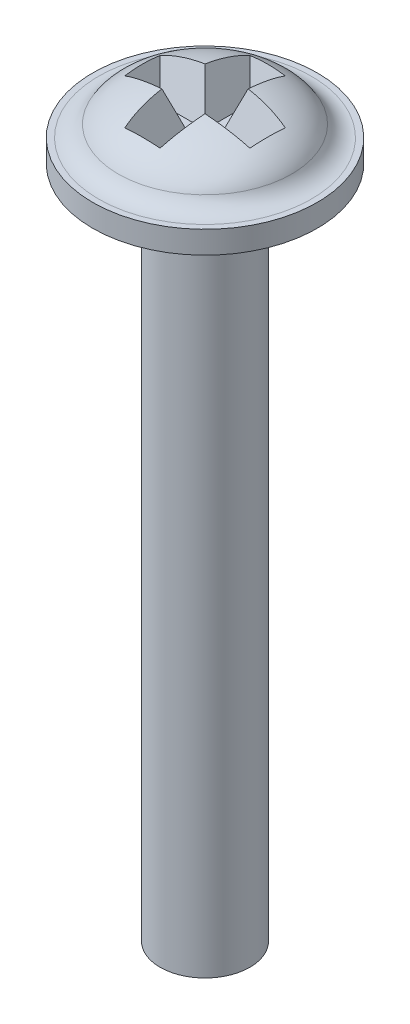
ISO-10303-21;
HEADER;
FILE_DESCRIPTION(('STEP AP214'),'2;1');
FILE_NAME('part.step','',(''),(''),'','','');
FILE_SCHEMA(('AUTOMOTIVE_DESIGN { 1 0 10303 214 1 1 1 1 }'));
ENDSEC;
DATA;
#1=APPLICATION_CONTEXT('core data for automotive mechanical design processes');
#2=APPLICATION_PROTOCOL_DEFINITION('international standard','automotive_design',2000,#1);
#3=PRODUCT_CONTEXT('',#1,'mechanical');
#4=PRODUCT('Part','Part','',(#3));
#5=PRODUCT_RELATED_PRODUCT_CATEGORY('part','',(#4));
#6=PRODUCT_DEFINITION_FORMATION('','',#4);
#7=PRODUCT_DEFINITION_CONTEXT('part definition',#1,'design');
#8=PRODUCT_DEFINITION('design','',#6,#7);
#9=PRODUCT_DEFINITION_SHAPE('','',#8);
#10=(LENGTH_UNIT() NAMED_UNIT(*) SI_UNIT(.MILLI.,.METRE.));
#11=(NAMED_UNIT(*) PLANE_ANGLE_UNIT() SI_UNIT($,.RADIAN.));
#12=(NAMED_UNIT(*) SI_UNIT($,.STERADIAN.) SOLID_ANGLE_UNIT());
#13=UNCERTAINTY_MEASURE_WITH_UNIT(LENGTH_MEASURE(1.E-05),#10,'distance_accuracy_value','');
#14=(GEOMETRIC_REPRESENTATION_CONTEXT(3) GLOBAL_UNCERTAINTY_ASSIGNED_CONTEXT((#13)) GLOBAL_UNIT_ASSIGNED_CONTEXT((#10,
#11,#12)) REPRESENTATION_CONTEXT('',''));
#15=CARTESIAN_POINT('',(0.,0.,0.));
#16=DIRECTION('',(0.,0.,1.));
#17=DIRECTION('',(1.,0.,0.));
#18=AXIS2_PLACEMENT_3D('',#15,#16,#17);
#19=CARTESIAN_POINT('',(0.,0.,0.));
#20=DIRECTION('',(0.,1.,0.));
#21=DIRECTION('',(0.,0.,1.));
#22=AXIS2_PLACEMENT_3D('',#19,#20,#21);
#23=PLANE('',#22);
#24=CARTESIAN_POINT('',(0.,0.,0.));
#25=DIRECTION('',(0.,1.,0.));
#26=DIRECTION('',(0.,0.,1.));
#27=AXIS2_PLACEMENT_3D('',#24,#25,#26);
#28=CIRCLE('',#27,2.5);
#29=CARTESIAN_POINT('',(0.,0.,2.5));
#30=VERTEX_POINT('',#29);
#31=EDGE_CURVE('E147',#30,#30,#28,.T.);
#32=ORIENTED_EDGE('',*,*,#31,.F.);
#33=EDGE_LOOP('',(#32));
#34=FACE_BOUND('',#33,.T.);
#35=CARTESIAN_POINT('',(0.,0.,0.));
#36=DIRECTION('',(0.,1.,0.));
#37=DIRECTION('',(0.,0.,1.));
#38=AXIS2_PLACEMENT_3D('',#35,#36,#37);
#39=CIRCLE('',#38,1.);
#40=CARTESIAN_POINT('',(0.,0.,1.));
#41=VERTEX_POINT('',#40);
#42=EDGE_CURVE('E11',#41,#41,#39,.F.);
#43=ORIENTED_EDGE('',*,*,#42,.F.);
#44=EDGE_LOOP('',(#43));
#45=FACE_BOUND('',#44,.T.);
#46=ADVANCED_FACE('F33',(#34,#45),#23,.F.);
#47=CARTESIAN_POINT('',(0.,0.5,0.));
#48=DIRECTION('',(0.,-1.,0.));
#49=DIRECTION('',(0.,0.,-1.));
#50=AXIS2_PLACEMENT_3D('',#47,#48,#49);
#51=CYLINDRICAL_SURFACE('',#50,2.5);
#52=CARTESIAN_POINT('',(0.,0.5,0.));
#53=DIRECTION('',(0.,1.,0.));
#54=DIRECTION('',(0.,0.,1.));
#55=AXIS2_PLACEMENT_3D('',#52,#53,#54);
#56=CIRCLE('',#55,2.5);
#57=CARTESIAN_POINT('',(0.,0.5,2.5));
#58=VERTEX_POINT('',#57);
#59=EDGE_CURVE('E150',#58,#58,#56,.T.);
#60=ORIENTED_EDGE('',*,*,#59,.F.);
#61=EDGE_LOOP('',(#60));
#62=FACE_BOUND('',#61,.T.);
#63=ORIENTED_EDGE('',*,*,#31,.T.);
#64=EDGE_LOOP('',(#63));
#65=FACE_BOUND('',#64,.T.);
#66=ADVANCED_FACE('F296',(#62,#65),#51,.T.);
#67=CARTESIAN_POINT('',(0.,0.5,0.));
#68=DIRECTION('',(0.,1.,0.));
#69=DIRECTION('',(0.,0.,1.));
#70=AXIS2_PLACEMENT_3D('',#67,#68,#69);
#71=PLANE('',#70);
#72=CARTESIAN_POINT('',(0.,0.5,0.));
#73=DIRECTION('',(0.,1.,0.));
#74=DIRECTION('',(0.,0.,1.));
#75=AXIS2_PLACEMENT_3D('',#72,#73,#74);
#76=CIRCLE('',#75,2.36985867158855);
#77=CARTESIAN_POINT('',(0.,0.5,2.36985867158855));
#78=VERTEX_POINT('',#77);
#79=EDGE_CURVE('E381',#78,#78,#76,.F.);
#80=ORIENTED_EDGE('',*,*,#79,.T.);
#81=EDGE_LOOP('',(#80));
#82=FACE_BOUND('',#81,.T.);
#83=ORIENTED_EDGE('',*,*,#59,.T.);
#84=EDGE_LOOP('',(#83));
#85=FACE_BOUND('',#84,.T.);
#86=ADVANCED_FACE('F166',(#82,#85),#71,.T.);
#87=CARTESIAN_POINT('',(0.,0.5,0.));
#88=DIRECTION('',(1.,0.,0.));
#89=DIRECTION('',(0.,0.,1.));
#90=AXIS2_PLACEMENT_3D('',#87,#88,#89);
#91=ELLIPSE('',#90,2.,1.);
#92=TRIMMED_CURVE('',#91,(PARAMETER_VALUE(4.71238898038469)),
(PARAMETER_VALUE(7.85398163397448)),.T.,.PARAMETER.);
#93=CARTESIAN_POINT('',(0.,1.5,0.));
#94=DIRECTION('',(0.,1.,0.));
#95=AXIS1_PLACEMENT('',#93,#94);
#96=SURFACE_OF_REVOLUTION('',#92,#95);
#97=CARTESIAN_POINT('',(0.488598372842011,1.46688727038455,-0.14760642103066));
#98=CARTESIAN_POINT('',(0.487805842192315,1.46458559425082,-0.210325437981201));
#99=CARTESIAN_POINT('',(0.486513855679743,1.4608333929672,-0.272967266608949));
#100=CARTESIAN_POINT('',(0.482894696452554,1.45032259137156,-0.397985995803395));
#101=CARTESIAN_POINT('',(0.480567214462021,1.44356309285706,-0.460362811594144));
#102=CARTESIAN_POINT('',(0.47206777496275,1.41887892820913,-0.64492896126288));
#103=CARTESIAN_POINT('',(0.464355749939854,1.39648158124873,-0.766524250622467));
#104=CARTESIAN_POINT('',(0.44974084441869,1.35403681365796,-0.940114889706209));
#105=CARTESIAN_POINT('',(0.444720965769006,1.33945802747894,-0.993648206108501));
#106=CARTESIAN_POINT('',(0.433630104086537,1.30724782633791,-1.09965987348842));
#107=CARTESIAN_POINT('',(0.427559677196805,1.28961802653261,-1.15213876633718));
#108=CARTESIAN_POINT('',(0.414162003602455,1.25070835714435,-1.25640518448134));
#109=CARTESIAN_POINT('',(0.406818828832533,1.22938222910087,-1.30817368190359));
#110=CARTESIAN_POINT('',(0.394782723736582,1.19442684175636,-1.38435442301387));
#111=CARTESIAN_POINT('',(0.390596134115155,1.18226810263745,-1.4095251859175));
#112=CARTESIAN_POINT('',(0.381856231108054,1.15688558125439,-1.45927020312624));
#113=CARTESIAN_POINT('',(0.377302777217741,1.14366139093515,-1.48384422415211));
#114=CARTESIAN_POINT('',(0.372553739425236,1.12986918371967,-1.50806596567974));
#115=B_SPLINE_CURVE_WITH_KNOTS('',3,(#97,#98,#99,#100,#101,#102,#103,#104,#105,#106,#107,#108,
#109,#110,#111,#112,#113,#114),.UNSPECIFIED.,.F.,.F.,(4,2,2,2,2,2,2,2,4),(0.,0.188241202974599,
0.376538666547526,0.747243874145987,0.914295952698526,1.08125986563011,1.25048808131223,
1.33525858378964,1.42006170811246),.UNSPECIFIED.);
#116=CARTESIAN_POINT('',(0.479595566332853,1.44074122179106,-0.479595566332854));
#117=VERTEX_POINT('',#116);
#118=CARTESIAN_POINT('',(0.393247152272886,1.18996721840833,-1.39324715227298));
#119=VERTEX_POINT('',#118);
#120=EDGE_CURVE('E41',#117,#119,#115,.T.);
#121=ORIENTED_EDGE('',*,*,#120,.F.);
#122=CARTESIAN_POINT('',(1.50806596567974,1.12986918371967,-0.372553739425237));
#123=CARTESIAN_POINT('',(1.47144651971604,1.15070678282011,-0.379728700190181));
#124=CARTESIAN_POINT('',(1.43403983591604,1.17025925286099,-0.386461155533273));
#125=CARTESIAN_POINT('',(1.35805182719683,1.20697635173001,-0.399103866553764));
#126=CARTESIAN_POINT('',(1.31947368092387,1.22414684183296,-0.405016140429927));
#127=CARTESIAN_POINT('',(1.2413768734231,1.25637591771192,-0.41611350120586));
#128=CARTESIAN_POINT('',(1.20185872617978,1.2714356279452,-0.421298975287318));
#129=CARTESIAN_POINT('',(1.12265193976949,1.29941989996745,-0.430934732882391));
#130=CARTESIAN_POINT('',(1.08297438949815,1.31237264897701,-0.435394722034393));
#131=CARTESIAN_POINT('',(1.00301206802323,1.33655252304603,-0.443720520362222));
#132=CARTESIAN_POINT('',(0.962726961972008,1.34777865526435,-0.447585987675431));
#133=CARTESIAN_POINT('',(0.881689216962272,1.36860601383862,-0.454757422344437));
#134=CARTESIAN_POINT('',(0.840936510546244,1.37820700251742,-0.458063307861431));
#135=CARTESIAN_POINT('',(0.693671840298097,1.40999370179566,-0.469008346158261));
#136=CARTESIAN_POINT('',(0.586062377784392,1.42779526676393,-0.475137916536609));
#137=CARTESIAN_POINT('',(0.423074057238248,1.44761470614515,-0.481962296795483));
#138=CARTESIAN_POINT('',(0.368116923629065,1.45308672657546,-0.483846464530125));
#139=CARTESIAN_POINT('',(0.257994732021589,1.46171082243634,-0.486815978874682));
#140=CARTESIAN_POINT('',(0.202829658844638,1.4648627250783,-0.487901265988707));
#141=CARTESIAN_POINT('',(0.147606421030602,1.46688727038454,-0.488598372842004));
#142=B_SPLINE_CURVE_WITH_KNOTS('',3,(#122,#123,#124,#125,#126,#127,#128,#129,#130,#131,#132,
#133,#134,#135,#136,#137,#138,#139,#140,#141),.UNSPECIFIED.,.F.,.F.,(4,2,2,2,2,2,2,2,2,4),(0.,
0.128151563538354,0.255981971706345,0.383744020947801,0.50962383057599,0.635575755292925,
0.761546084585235,1.08865966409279,1.25440284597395,1.42015837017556),.UNSPECIFIED.);
#143=CARTESIAN_POINT('',(1.39324715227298,1.18996721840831,-0.393247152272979));
#144=VERTEX_POINT('',#143);
#145=EDGE_CURVE('E56',#144,#117,#142,.T.);
#146=ORIENTED_EDGE('',*,*,#145,.F.);
#147=CARTESIAN_POINT('',(1.38780409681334,1.17415943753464,0.506));
#148=CARTESIAN_POINT('',(1.39010870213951,1.18085249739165,0.463981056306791));
#149=CARTESIAN_POINT('',(1.39210765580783,1.18665788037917,0.421807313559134));
#150=CARTESIAN_POINT('',(1.39550419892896,1.19652215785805,0.337450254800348));
#151=CARTESIAN_POINT('',(1.39690480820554,1.20058982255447,0.295268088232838));
#152=CARTESIAN_POINT('',(1.39913404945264,1.20706400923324,0.210903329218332));
#153=CARTESIAN_POINT('',(1.39996456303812,1.20947599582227,0.168721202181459));
#154=CARTESIAN_POINT('',(1.40106927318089,1.21268430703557,0.0843593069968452));
#155=CARTESIAN_POINT('',(1.40134440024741,1.21348333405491,0.042179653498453));
#156=CARTESIAN_POINT('',(1.40134440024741,1.21348333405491,-0.0421796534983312));
#157=CARTESIAN_POINT('',(1.40106927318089,1.21268430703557,-0.0843593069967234));
#158=CARTESIAN_POINT('',(1.39996456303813,1.20947599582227,-0.168721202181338));
#159=CARTESIAN_POINT('',(1.39913404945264,1.20706400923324,-0.210903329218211));
#160=CARTESIAN_POINT('',(1.39690480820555,1.20058982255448,-0.295268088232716));
#161=CARTESIAN_POINT('',(1.39550419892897,1.19652215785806,-0.337450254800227));
#162=CARTESIAN_POINT('',(1.39210765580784,1.18665788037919,-0.421807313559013));
#163=CARTESIAN_POINT('',(1.39010870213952,1.18085249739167,-0.463981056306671));
#164=CARTESIAN_POINT('',(1.38780409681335,1.17415943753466,-0.50599999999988));
#165=B_SPLINE_CURVE_WITH_KNOTS('',3,(#147,#148,#149,#150,#151,#152,#153,#154,#155,#156,#157,
#158,#159,#160,#161,#162,#163,#164),.UNSPECIFIED.,.F.,.F.,(4,2,2,2,2,2,2,2,4),(0.,
0.127817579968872,0.254982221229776,0.381725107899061,0.508255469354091,0.63478583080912,
0.761528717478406,0.888693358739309,1.01651093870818),.UNSPECIFIED.);
#166=CARTESIAN_POINT('',(1.39324715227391,1.18996721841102,0.393247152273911));
#167=VERTEX_POINT('',#166);
#168=EDGE_CURVE('E238',#167,#144,#165,.T.);
#169=ORIENTED_EDGE('',*,*,#168,.F.);
#170=CARTESIAN_POINT('',(0.147606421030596,1.46688727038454,0.488598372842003));
#171=CARTESIAN_POINT('',(0.210325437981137,1.46458559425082,0.487805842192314));
#172=CARTESIAN_POINT('',(0.272967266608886,1.46083339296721,0.486513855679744));
#173=CARTESIAN_POINT('',(0.397985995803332,1.45032259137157,0.482894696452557));
#174=CARTESIAN_POINT('',(0.46036281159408,1.44356309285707,0.480567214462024));
#175=CARTESIAN_POINT('',(0.644928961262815,1.41887892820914,0.472067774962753));
#176=CARTESIAN_POINT('',(0.766524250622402,1.39648158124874,0.464355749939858));
#177=CARTESIAN_POINT('',(0.94011488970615,1.35403681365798,0.449740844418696));
#178=CARTESIAN_POINT('',(0.993648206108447,1.33945802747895,0.444720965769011));
#179=CARTESIAN_POINT('',(1.09965987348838,1.30724782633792,0.433630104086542));
#180=CARTESIAN_POINT('',(1.15213876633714,1.28961802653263,0.427559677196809));
#181=CARTESIAN_POINT('',(1.25640518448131,1.25070835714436,0.414162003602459));
#182=CARTESIAN_POINT('',(1.30817368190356,1.22938222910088,0.406818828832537));
#183=CARTESIAN_POINT('',(1.38435442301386,1.19442684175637,0.394782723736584));
#184=CARTESIAN_POINT('',(1.40952518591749,1.18226810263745,0.390596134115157));
#185=CARTESIAN_POINT('',(1.45927020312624,1.1568855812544,0.381856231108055));
#186=CARTESIAN_POINT('',(1.48384422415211,1.14366139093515,0.377302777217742));
#187=CARTESIAN_POINT('',(1.50806596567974,1.12986918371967,0.372553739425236));
#188=B_SPLINE_CURVE_WITH_KNOTS('',3,(#170,#171,#172,#173,#174,#175,#176,#177,#178,#179,#180,
#181,#182,#183,#184,#185,#186,#187),.UNSPECIFIED.,.F.,.F.,(4,2,2,2,2,2,2,2,4),(0.,
0.188241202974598,0.376538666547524,0.747243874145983,0.914295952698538,1.08125986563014,
1.25048808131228,1.33525858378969,1.42006170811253),.UNSPECIFIED.);
#189=CARTESIAN_POINT('',(0.479595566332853,1.44074122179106,0.479595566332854));
#190=VERTEX_POINT('',#189);
#191=EDGE_CURVE('E232',#190,#167,#188,.T.);
#192=ORIENTED_EDGE('',*,*,#191,.F.);
#193=CARTESIAN_POINT('',(0.372553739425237,1.12986918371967,1.50806596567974));
#194=CARTESIAN_POINT('',(0.37972870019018,1.15070678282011,1.47144651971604));
#195=CARTESIAN_POINT('',(0.386461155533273,1.17025925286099,1.43403983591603));
#196=CARTESIAN_POINT('',(0.399103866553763,1.20697635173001,1.35805182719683));
#197=CARTESIAN_POINT('',(0.405016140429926,1.22414684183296,1.31947368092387));
#198=CARTESIAN_POINT('',(0.41611350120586,1.25637591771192,1.2413768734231));
#199=CARTESIAN_POINT('',(0.421298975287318,1.2714356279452,1.20185872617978));
#200=CARTESIAN_POINT('',(0.430934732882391,1.29941989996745,1.12265193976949));
#201=CARTESIAN_POINT('',(0.435394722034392,1.31237264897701,1.08297438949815));
#202=CARTESIAN_POINT('',(0.443720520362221,1.33655252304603,1.00301206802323));
#203=CARTESIAN_POINT('',(0.447585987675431,1.34777865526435,0.962726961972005));
#204=CARTESIAN_POINT('',(0.454757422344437,1.36860601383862,0.881689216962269));
#205=CARTESIAN_POINT('',(0.458063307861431,1.37820700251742,0.84093651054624));
#206=CARTESIAN_POINT('',(0.469008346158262,1.40999370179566,0.693671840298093));
#207=CARTESIAN_POINT('',(0.475137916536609,1.42779526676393,0.586062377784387));
#208=CARTESIAN_POINT('',(0.481962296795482,1.44761470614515,0.423074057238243));
#209=CARTESIAN_POINT('',(0.483846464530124,1.45308672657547,0.36811692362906));
#210=CARTESIAN_POINT('',(0.486815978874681,1.46171082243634,0.257994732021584));
#211=CARTESIAN_POINT('',(0.487901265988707,1.4648627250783,0.202829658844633));
#212=CARTESIAN_POINT('',(0.488598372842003,1.46688727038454,0.147606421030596));
#213=B_SPLINE_CURVE_WITH_KNOTS('',3,(#193,#194,#195,#196,#197,#198,#199,#200,#201,#202,#203,
#204,#205,#206,#207,#208,#209,#210,#211,#212),.UNSPECIFIED.,.F.,.F.,(4,2,2,2,2,2,2,2,2,4),(0.,
0.128151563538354,0.255981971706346,0.383744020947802,0.509623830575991,0.635575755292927,
0.761546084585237,1.08865966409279,1.25440284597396,1.42015837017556),.UNSPECIFIED.);
#214=CARTESIAN_POINT('',(0.393247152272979,1.18996721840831,1.39324715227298));
#215=VERTEX_POINT('',#214);
#216=EDGE_CURVE('E225',#215,#190,#213,.T.);
#217=ORIENTED_EDGE('',*,*,#216,.F.);
#218=CARTESIAN_POINT('',(-0.506,1.17415943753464,1.38780409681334));
#219=CARTESIAN_POINT('',(-0.463981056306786,1.18085249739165,1.39010870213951));
#220=CARTESIAN_POINT('',(-0.421807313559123,1.18665788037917,1.39210765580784));
#221=CARTESIAN_POINT('',(-0.337450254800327,1.19652215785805,1.39550419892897));
#222=CARTESIAN_POINT('',(-0.295268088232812,1.20058982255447,1.39690480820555));
#223=CARTESIAN_POINT('',(-0.210903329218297,1.20706400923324,1.39913404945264));
#224=CARTESIAN_POINT('',(-0.168721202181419,1.20947599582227,1.39996456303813));
#225=CARTESIAN_POINT('',(-0.0843593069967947,1.21268430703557,1.40106927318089));
#226=CARTESIAN_POINT('',(-0.0421796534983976,1.21348333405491,1.40134440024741));
#227=CARTESIAN_POINT('',(0.0421796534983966,1.21348333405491,1.40134440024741));
#228=CARTESIAN_POINT('',(0.0843593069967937,1.21268430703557,1.40106927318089));
#229=CARTESIAN_POINT('',(0.168721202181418,1.20947599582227,1.39996456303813));
#230=CARTESIAN_POINT('',(0.210903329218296,1.20706400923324,1.39913404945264));
#231=CARTESIAN_POINT('',(0.295268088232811,1.20058982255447,1.39690480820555));
#232=CARTESIAN_POINT('',(0.337450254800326,1.19652215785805,1.39550419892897));
#233=CARTESIAN_POINT('',(0.421807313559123,1.18665788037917,1.39210765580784));
#234=CARTESIAN_POINT('',(0.463981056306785,1.18085249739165,1.39010870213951));
#235=CARTESIAN_POINT('',(0.505999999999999,1.17415943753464,1.38780409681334));
#236=B_SPLINE_CURVE_WITH_KNOTS('',3,(#218,#219,#220,#221,#222,#223,#224,#225,#226,#227,#228,
#229,#230,#231,#232,#233,#234,#235),.UNSPECIFIED.,.F.,.F.,(4,2,2,2,2,2,2,2,4),(0.,
0.127817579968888,0.254982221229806,0.381725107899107,0.508255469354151,0.634785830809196,
0.761528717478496,0.888693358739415,1.0165109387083),.UNSPECIFIED.);
#237=CARTESIAN_POINT('',(-0.393247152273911,1.18996721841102,1.39324715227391));
#238=VERTEX_POINT('',#237);
#239=EDGE_CURVE('E218',#238,#215,#236,.T.);
#240=ORIENTED_EDGE('',*,*,#239,.F.);
#241=CARTESIAN_POINT('',(-0.488598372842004,1.46688727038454,0.147606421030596));
#242=CARTESIAN_POINT('',(-0.487805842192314,1.46458559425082,0.210325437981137));
#243=CARTESIAN_POINT('',(-0.486513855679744,1.46083339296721,0.272967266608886));
#244=CARTESIAN_POINT('',(-0.482894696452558,1.45032259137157,0.397985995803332));
#245=CARTESIAN_POINT('',(-0.480567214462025,1.44356309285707,0.46036281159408));
#246=CARTESIAN_POINT('',(-0.472067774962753,1.41887892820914,0.644928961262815));
#247=CARTESIAN_POINT('',(-0.464355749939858,1.39648158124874,0.766524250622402));
#248=CARTESIAN_POINT('',(-0.449740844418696,1.35403681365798,0.94011488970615));
#249=CARTESIAN_POINT('',(-0.444720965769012,1.33945802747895,0.993648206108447));
#250=CARTESIAN_POINT('',(-0.433630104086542,1.30724782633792,1.09965987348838));
#251=CARTESIAN_POINT('',(-0.42755967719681,1.28961802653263,1.15213876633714));
#252=CARTESIAN_POINT('',(-0.414162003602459,1.25070835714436,1.25640518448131));
#253=CARTESIAN_POINT('',(-0.406818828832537,1.22938222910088,1.30817368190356));
#254=CARTESIAN_POINT('',(-0.394782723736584,1.19442684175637,1.38435442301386));
#255=CARTESIAN_POINT('',(-0.390596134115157,1.18226810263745,1.40952518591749));
#256=CARTESIAN_POINT('',(-0.381856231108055,1.1568855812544,1.45927020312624));
#257=CARTESIAN_POINT('',(-0.377302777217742,1.14366139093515,1.48384422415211));
#258=CARTESIAN_POINT('',(-0.372553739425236,1.12986918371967,1.50806596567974));
#259=B_SPLINE_CURVE_WITH_KNOTS('',3,(#241,#242,#243,#244,#245,#246,#247,#248,#249,#250,#251,
#252,#253,#254,#255,#256,#257,#258),.UNSPECIFIED.,.F.,.F.,(4,2,2,2,2,2,2,2,4),(0.,
0.188241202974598,0.376538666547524,0.747243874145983,0.914295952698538,1.08125986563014,
1.25048808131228,1.33525858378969,1.42006170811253),.UNSPECIFIED.);
#260=CARTESIAN_POINT('',(-0.479595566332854,1.44074122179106,0.479595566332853));
#261=VERTEX_POINT('',#260);
#262=EDGE_CURVE('E211',#261,#238,#259,.T.);
#263=ORIENTED_EDGE('',*,*,#262,.F.);
#264=CARTESIAN_POINT('',(-1.50806596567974,1.12986918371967,0.372553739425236));
#265=CARTESIAN_POINT('',(-1.47144651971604,1.15070678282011,0.37972870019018));
#266=CARTESIAN_POINT('',(-1.43403983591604,1.17025925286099,0.386461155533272));
#267=CARTESIAN_POINT('',(-1.35805182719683,1.20697635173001,0.399103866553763));
#268=CARTESIAN_POINT('',(-1.31947368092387,1.22414684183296,0.405016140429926));
#269=CARTESIAN_POINT('',(-1.2413768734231,1.25637591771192,0.416113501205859));
#270=CARTESIAN_POINT('',(-1.20185872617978,1.27143562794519,0.421298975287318));
#271=CARTESIAN_POINT('',(-1.12265193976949,1.29941989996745,0.43093473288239));
#272=CARTESIAN_POINT('',(-1.08297438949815,1.31237264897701,0.435394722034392));
#273=CARTESIAN_POINT('',(-1.00301206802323,1.33655252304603,0.443720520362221));
#274=CARTESIAN_POINT('',(-0.96272696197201,1.34777865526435,0.447585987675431));
#275=CARTESIAN_POINT('',(-0.881689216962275,1.36860601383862,0.454757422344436));
#276=CARTESIAN_POINT('',(-0.840936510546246,1.37820700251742,0.45806330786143));
#277=CARTESIAN_POINT('',(-0.693671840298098,1.40999370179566,0.46900834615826));
#278=CARTESIAN_POINT('',(-0.586062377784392,1.42779526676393,0.475137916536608));
#279=CARTESIAN_POINT('',(-0.423074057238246,1.44761470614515,0.481962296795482));
#280=CARTESIAN_POINT('',(-0.368116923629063,1.45308672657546,0.483846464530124));
#281=CARTESIAN_POINT('',(-0.257994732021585,1.46171082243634,0.486815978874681));
#282=CARTESIAN_POINT('',(-0.202829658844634,1.4648627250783,0.487901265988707));
#283=CARTESIAN_POINT('',(-0.147606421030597,1.46688727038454,0.488598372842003));
#284=B_SPLINE_CURVE_WITH_KNOTS('',3,(#264,#265,#266,#267,#268,#269,#270,#271,#272,#273,#274,
#275,#276,#277,#278,#279,#280,#281,#282,#283),.UNSPECIFIED.,.F.,.F.,(4,2,2,2,2,2,2,2,2,4),(0.,
0.128151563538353,0.255981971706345,0.3837440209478,0.509623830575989,0.635575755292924,
0.761546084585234,1.08865966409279,1.25440284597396,1.42015837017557),.UNSPECIFIED.);
#285=CARTESIAN_POINT('',(-1.39324715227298,1.18996721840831,0.393247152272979));
#286=VERTEX_POINT('',#285);
#287=EDGE_CURVE('E204',#286,#261,#284,.T.);
#288=ORIENTED_EDGE('',*,*,#287,.F.);
#289=CARTESIAN_POINT('',(-1.38780409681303,1.17415943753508,-0.505999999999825));
#290=CARTESIAN_POINT('',(-1.3901087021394,1.18085249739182,-0.463981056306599));
#291=CARTESIAN_POINT('',(-1.39210765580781,1.18665788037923,-0.42180731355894));
#292=CARTESIAN_POINT('',(-1.395504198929,1.19652215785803,-0.337450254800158));
#293=CARTESIAN_POINT('',(-1.39690480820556,1.20058982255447,-0.295268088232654));
#294=CARTESIAN_POINT('',(-1.39913404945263,1.20706400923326,-0.210903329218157));
#295=CARTESIAN_POINT('',(-1.39996456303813,1.20947599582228,-0.168721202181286));
#296=CARTESIAN_POINT('',(-1.40106927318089,1.21268430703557,-0.084359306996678));
#297=CARTESIAN_POINT('',(-1.40134440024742,1.21348333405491,-0.0421796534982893));
#298=CARTESIAN_POINT('',(-1.40134440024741,1.21348333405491,0.0421796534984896));
#299=CARTESIAN_POINT('',(-1.40106927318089,1.21268430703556,0.0843593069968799));
#300=CARTESIAN_POINT('',(-1.39996456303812,1.20947599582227,0.168721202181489));
#301=CARTESIAN_POINT('',(-1.39913404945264,1.20706400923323,0.210903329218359));
#302=CARTESIAN_POINT('',(-1.39690480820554,1.20058982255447,0.295268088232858));
#303=CARTESIAN_POINT('',(-1.39550419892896,1.19652215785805,0.337450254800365));
#304=CARTESIAN_POINT('',(-1.39210765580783,1.18665788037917,0.421807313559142));
#305=CARTESIAN_POINT('',(-1.39010870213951,1.18085249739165,0.463981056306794));
#306=CARTESIAN_POINT('',(-1.38780409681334,1.17415943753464,0.505999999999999));
#307=B_SPLINE_CURVE_WITH_KNOTS('',3,(#289,#290,#291,#292,#293,#294,#295,#296,#297,#298,#299,
#300,#301,#302,#303,#304,#305,#306),.UNSPECIFIED.,.F.,.F.,(4,2,2,2,2,2,2,2,4),(0.,
0.127817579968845,0.254982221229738,0.381725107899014,0.508255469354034,0.634785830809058,
0.761528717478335,0.888693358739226,1.01651093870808),.UNSPECIFIED.);
#308=CARTESIAN_POINT('',(-1.39324715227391,1.18996721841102,-0.393247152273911));
#309=VERTEX_POINT('',#308);
#310=EDGE_CURVE('E197',#309,#286,#307,.T.);
#311=ORIENTED_EDGE('',*,*,#310,.F.);
#312=CARTESIAN_POINT('',(-0.147606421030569,1.46688727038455,-0.488598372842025));
#313=CARTESIAN_POINT('',(-0.21032543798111,1.46458559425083,-0.487805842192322));
#314=CARTESIAN_POINT('',(-0.272967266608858,1.46083339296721,-0.486513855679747));
#315=CARTESIAN_POINT('',(-0.397985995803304,1.45032259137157,-0.482894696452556));
#316=CARTESIAN_POINT('',(-0.460362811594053,1.44356309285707,-0.480567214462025));
#317=CARTESIAN_POINT('',(-0.64492896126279,1.41887892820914,-0.472067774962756));
#318=CARTESIAN_POINT('',(-0.766524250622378,1.39648158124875,-0.46435574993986));
#319=CARTESIAN_POINT('',(-0.940114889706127,1.35403681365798,-0.449740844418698));
#320=CARTESIAN_POINT('',(-0.993648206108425,1.33945802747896,-0.444720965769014));
#321=CARTESIAN_POINT('',(-1.09965987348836,1.30724782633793,-0.433630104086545));
#322=CARTESIAN_POINT('',(-1.15213876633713,1.28961802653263,-0.427559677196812));
#323=CARTESIAN_POINT('',(-1.25640518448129,1.25070835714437,-0.414162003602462));
#324=CARTESIAN_POINT('',(-1.30817368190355,1.22938222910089,-0.406818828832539));
#325=CARTESIAN_POINT('',(-1.38435442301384,1.19442684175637,-0.394782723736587));
#326=CARTESIAN_POINT('',(-1.40952518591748,1.18226810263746,-0.39059613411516));
#327=CARTESIAN_POINT('',(-1.45927020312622,1.1568855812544,-0.381856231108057));
#328=CARTESIAN_POINT('',(-1.4838442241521,1.14366139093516,-0.377302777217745));
#329=CARTESIAN_POINT('',(-1.50806596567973,1.12986918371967,-0.372553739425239));
#330=B_SPLINE_CURVE_WITH_KNOTS('',3,(#312,#313,#314,#315,#316,#317,#318,#319,#320,#321,#322,
#323,#324,#325,#326,#327,#328,#329),.UNSPECIFIED.,.F.,.F.,(4,2,2,2,2,2,2,2,4),(0.,
0.188241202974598,0.376538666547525,0.747243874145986,0.914295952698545,1.08125986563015,
1.25048808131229,1.3352585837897,1.42006170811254),.UNSPECIFIED.);
#331=CARTESIAN_POINT('',(-0.479595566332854,1.44074122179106,-0.479595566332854));
#332=VERTEX_POINT('',#331);
#333=EDGE_CURVE('E190',#332,#309,#330,.T.);
#334=ORIENTED_EDGE('',*,*,#333,.F.);
#335=CARTESIAN_POINT('',(-0.372553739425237,1.12986918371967,-1.50806596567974));
#336=CARTESIAN_POINT('',(-0.37972870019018,1.15070678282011,-1.47144651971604));
#337=CARTESIAN_POINT('',(-0.386461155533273,1.17025925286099,-1.43403983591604));
#338=CARTESIAN_POINT('',(-0.399103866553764,1.20697635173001,-1.35805182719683));
#339=CARTESIAN_POINT('',(-0.405016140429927,1.22414684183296,-1.31947368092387));
#340=CARTESIAN_POINT('',(-0.41611350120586,1.25637591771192,-1.2413768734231));
#341=CARTESIAN_POINT('',(-0.421298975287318,1.2714356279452,-1.20185872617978));
#342=CARTESIAN_POINT('',(-0.430934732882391,1.29941989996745,-1.12265193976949));
#343=CARTESIAN_POINT('',(-0.435394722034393,1.31237264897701,-1.08297438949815));
#344=CARTESIAN_POINT('',(-0.443720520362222,1.33655252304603,-1.00301206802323));
#345=CARTESIAN_POINT('',(-0.447585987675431,1.34777865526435,-0.962726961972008));
#346=CARTESIAN_POINT('',(-0.454757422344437,1.36860601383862,-0.881689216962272));
#347=CARTESIAN_POINT('',(-0.458063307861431,1.37820700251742,-0.840936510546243));
#348=CARTESIAN_POINT('',(-0.469008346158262,1.40999370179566,-0.693671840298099));
#349=CARTESIAN_POINT('',(-0.475137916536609,1.42779526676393,-0.586062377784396));
#350=CARTESIAN_POINT('',(-0.481962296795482,1.44761470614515,-0.423074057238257));
#351=CARTESIAN_POINT('',(-0.483846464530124,1.45308672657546,-0.368116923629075));
#352=CARTESIAN_POINT('',(-0.486815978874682,1.46171082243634,-0.257994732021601));
#353=CARTESIAN_POINT('',(-0.487901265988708,1.4648627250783,-0.202829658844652));
#354=CARTESIAN_POINT('',(-0.488598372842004,1.46688727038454,-0.147606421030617));
#355=B_SPLINE_CURVE_WITH_KNOTS('',3,(#335,#336,#337,#338,#339,#340,#341,#342,#343,#344,#345,
#346,#347,#348,#349,#350,#351,#352,#353,#354),.UNSPECIFIED.,.F.,.F.,(4,2,2,2,2,2,2,2,2,4),(0.,
0.128151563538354,0.255981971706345,0.383744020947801,0.50962383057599,0.635575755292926,
0.761546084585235,1.08865966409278,1.25440284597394,1.42015837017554),.UNSPECIFIED.);
#356=CARTESIAN_POINT('',(-0.393247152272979,1.18996721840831,-1.39324715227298));
#357=VERTEX_POINT('',#356);
#358=EDGE_CURVE('E183',#357,#332,#355,.T.);
#359=ORIENTED_EDGE('',*,*,#358,.F.);
#360=CARTESIAN_POINT('',(0.506,1.17415943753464,-1.38780409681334));
#361=CARTESIAN_POINT('',(0.463981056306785,1.18085249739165,-1.39010870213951));
#362=CARTESIAN_POINT('',(0.421807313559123,1.18665788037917,-1.39210765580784));
#363=CARTESIAN_POINT('',(0.337450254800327,1.19652215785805,-1.39550419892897));
#364=CARTESIAN_POINT('',(0.295268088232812,1.20058982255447,-1.39690480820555));
#365=CARTESIAN_POINT('',(0.210903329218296,1.20706400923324,-1.39913404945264));
#366=CARTESIAN_POINT('',(0.168721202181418,1.20947599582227,-1.39996456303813));
#367=CARTESIAN_POINT('',(0.084359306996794,1.21268430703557,-1.40106927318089));
#368=CARTESIAN_POINT('',(0.0421796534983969,1.21348333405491,-1.40134440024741));
#369=CARTESIAN_POINT('',(-0.0421796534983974,1.21348333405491,-1.40134440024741));
#370=CARTESIAN_POINT('',(-0.0843593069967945,1.21268430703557,-1.40106927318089));
#371=CARTESIAN_POINT('',(-0.168721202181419,1.20947599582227,-1.39996456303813));
#372=CARTESIAN_POINT('',(-0.210903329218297,1.20706400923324,-1.39913404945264));
#373=CARTESIAN_POINT('',(-0.295268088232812,1.20058982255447,-1.39690480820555));
#374=CARTESIAN_POINT('',(-0.337450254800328,1.19652215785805,-1.39550419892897));
#375=CARTESIAN_POINT('',(-0.421807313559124,1.18665788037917,-1.39210765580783));
#376=CARTESIAN_POINT('',(-0.463981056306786,1.18085249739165,-1.39010870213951));
#377=CARTESIAN_POINT('',(-0.506,1.17415943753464,-1.38780409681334));
#378=B_SPLINE_CURVE_WITH_KNOTS('',3,(#360,#361,#362,#363,#364,#365,#366,#367,#368,#369,#370,
#371,#372,#373,#374,#375,#376,#377),.UNSPECIFIED.,.F.,.F.,(4,2,2,2,2,2,2,2,4),(0.,
0.127817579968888,0.254982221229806,0.381725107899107,0.508255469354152,0.634785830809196,
0.761528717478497,0.888693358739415,1.0165109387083),.UNSPECIFIED.);
#379=EDGE_CURVE('E142',#119,#357,#378,.T.);
#380=ORIENTED_EDGE('',*,*,#379,.F.);
#381=EDGE_LOOP('',(#121,#146,#169,#192,#217,#240,#263,#288,#311,#334,#359,#380));
#382=FACE_BOUND('',#381,.T.);
#383=CARTESIAN_POINT('',(0.,0.761667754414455,0.));
#384=DIRECTION('',(0.,1.,0.));
#385=DIRECTION('',(0.,0.,1.));
#386=AXIS2_PLACEMENT_3D('',#383,#384,#385);
#387=CIRCLE('',#386,1.93031602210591);
#388=CARTESIAN_POINT('',(0.,0.761667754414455,1.93031602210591));
#389=VERTEX_POINT('',#388);
#390=EDGE_CURVE('E383',#389,#389,#387,.T.);
#391=ORIENTED_EDGE('',*,*,#390,.T.);
#392=EDGE_LOOP('',(#391));
#393=FACE_BOUND('',#392,.T.);
#394=ADVANCED_FACE('F161',(#382,#393),#96,.F.);
#395=CARTESIAN_POINT('',(0.,0.999999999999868,0.));
#396=DIRECTION('',(0.,1.,0.));
#397=DIRECTION('',(0.,0.,1.));
#398=AXIS2_PLACEMENT_3D('',#395,#396,#397);
#399=TOROIDAL_SURFACE('',#398,2.36985867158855,0.5);
#400=ORIENTED_EDGE('',*,*,#79,.F.);
#401=EDGE_LOOP('',(#400));
#402=FACE_BOUND('',#401,.T.);
#403=ORIENTED_EDGE('',*,*,#390,.F.);
#404=EDGE_LOOP('',(#403));
#405=FACE_BOUND('',#404,.T.);
#406=ADVANCED_FACE('F35',(#402,#405),#399,.F.);
#407=CARTESIAN_POINT('',(0.5,1.5,-1.5));
#408=DIRECTION('',(0.945518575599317,-0.325568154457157,0.));
#409=DIRECTION('',(0.325568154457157,0.945518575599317,0.));
#410=AXIS2_PLACEMENT_3D('',#407,#408,#409);
#411=PLANE('',#410);
#412=ORIENTED_EDGE('',*,*,#120,.T.);
#413=DIRECTION('',(0.309574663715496,0.899070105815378,-0.309574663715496));
#414=VECTOR('',#413,1.);
#415=CARTESIAN_POINT('',(0.5,1.5,-1.5));
#416=LINE('',#415,#414);
#417=CARTESIAN_POINT('',(0.155672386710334,0.5,-1.15567238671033));
#418=VERTEX_POINT('',#417);
#419=EDGE_CURVE('E48',#418,#119,#416,.T.);
#420=ORIENTED_EDGE('',*,*,#419,.F.);
#421=DIRECTION('',(0.,0.,1.));
#422=VECTOR('',#421,1.);
#423=CARTESIAN_POINT('',(0.155672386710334,0.5,-1.5));
#424=LINE('',#423,#422);
#425=CARTESIAN_POINT('',(0.155672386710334,0.5,-0.155672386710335));
#426=VERTEX_POINT('',#425);
#427=EDGE_CURVE('E146',#418,#426,#424,.T.);
#428=ORIENTED_EDGE('',*,*,#427,.T.);
#429=DIRECTION('',(0.309574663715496,0.899070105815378,-0.309574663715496));
#430=VECTOR('',#429,1.);
#431=CARTESIAN_POINT('',(0.595836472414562,1.77832932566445,-0.595836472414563));
#432=LINE('',#431,#430);
#433=EDGE_CURVE('E136',#426,#117,#432,.T.);
#434=ORIENTED_EDGE('',*,*,#433,.T.);
#435=EDGE_LOOP('',(#412,#420,#428,#434));
#436=FACE_BOUND('',#435,.T.);
#437=ADVANCED_FACE('F250',(#436),#411,.F.);
#438=CARTESIAN_POINT('',(1.5,1.5,-0.5));
#439=DIRECTION('',(0.,-0.325568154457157,-0.945518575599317));
#440=DIRECTION('',(0.,0.945518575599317,-0.325568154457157));
#441=AXIS2_PLACEMENT_3D('',#438,#439,#440);
#442=PLANE('',#441);
#443=ORIENTED_EDGE('',*,*,#145,.T.);
#444=ORIENTED_EDGE('',*,*,#433,.F.);
#445=DIRECTION('',(1.,0.,0.));
#446=VECTOR('',#445,1.);
#447=CARTESIAN_POINT('',(1.5,0.5,-0.155672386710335));
#448=LINE('',#447,#446);
#449=CARTESIAN_POINT('',(1.15567238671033,0.5,-0.155672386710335));
#450=VERTEX_POINT('',#449);
#451=EDGE_CURVE('E152',#426,#450,#448,.T.);
#452=ORIENTED_EDGE('',*,*,#451,.T.);
#453=DIRECTION('',(0.309574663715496,0.899070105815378,-0.309574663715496));
#454=VECTOR('',#453,1.);
#455=CARTESIAN_POINT('',(1.5,1.5,-0.5));
#456=LINE('',#455,#454);
#457=EDGE_CURVE('E156',#450,#144,#456,.T.);
#458=ORIENTED_EDGE('',*,*,#457,.T.);
#459=EDGE_LOOP('',(#443,#444,#452,#458));
#460=FACE_BOUND('',#459,.T.);
#461=ADVANCED_FACE('F168',(#460),#442,.F.);
#462=CARTESIAN_POINT('',(1.5,1.5,-0.5));
#463=DIRECTION('',(0.945518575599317,-0.325568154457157,0.));
#464=DIRECTION('',(0.325568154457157,0.945518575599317,0.));
#465=AXIS2_PLACEMENT_3D('',#462,#463,#464);
#466=PLANE('',#465);
#467=ORIENTED_EDGE('',*,*,#168,.T.);
#468=ORIENTED_EDGE('',*,*,#457,.F.);
#469=DIRECTION('',(0.,0.,1.));
#470=VECTOR('',#469,1.);
#471=CARTESIAN_POINT('',(1.15567238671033,0.5,-0.500000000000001));
#472=LINE('',#471,#470);
#473=CARTESIAN_POINT('',(1.15567238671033,0.5,0.155672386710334));
#474=VERTEX_POINT('',#473);
#475=EDGE_CURVE('E335',#450,#474,#472,.T.);
#476=ORIENTED_EDGE('',*,*,#475,.T.);
#477=DIRECTION('',(0.309574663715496,0.899070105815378,0.309574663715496));
#478=VECTOR('',#477,1.);
#479=CARTESIAN_POINT('',(1.5,1.5,0.5));
#480=LINE('',#479,#478);
#481=EDGE_CURVE('E357',#474,#167,#480,.T.);
#482=ORIENTED_EDGE('',*,*,#481,.T.);
#483=EDGE_LOOP('',(#467,#468,#476,#482));
#484=FACE_BOUND('',#483,.T.);
#485=ADVANCED_FACE('F287',(#484),#466,.F.);
#486=CARTESIAN_POINT('',(1.5,1.5,0.5));
#487=DIRECTION('',(0.,-0.325568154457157,0.945518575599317));
#488=DIRECTION('',(0.,-0.945518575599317,-0.325568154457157));
#489=AXIS2_PLACEMENT_3D('',#486,#487,#488);
#490=PLANE('',#489);
#491=ORIENTED_EDGE('',*,*,#191,.T.);
#492=ORIENTED_EDGE('',*,*,#481,.F.);
#493=DIRECTION('',(-1.,0.,0.));
#494=VECTOR('',#493,1.);
#495=CARTESIAN_POINT('',(1.5,0.5,0.155672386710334));
#496=LINE('',#495,#494);
#497=CARTESIAN_POINT('',(0.155672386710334,0.5,0.155672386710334));
#498=VERTEX_POINT('',#497);
#499=EDGE_CURVE('E333',#474,#498,#496,.T.);
#500=ORIENTED_EDGE('',*,*,#499,.T.);
#501=DIRECTION('',(0.309574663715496,0.899070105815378,0.309574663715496));
#502=VECTOR('',#501,1.);
#503=CARTESIAN_POINT('',(0.595836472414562,1.77832932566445,0.595836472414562));
#504=LINE('',#503,#502);
#505=EDGE_CURVE('E355',#498,#190,#504,.T.);
#506=ORIENTED_EDGE('',*,*,#505,.T.);
#507=EDGE_LOOP('',(#491,#492,#500,#506));
#508=FACE_BOUND('',#507,.T.);
#509=ADVANCED_FACE('F283',(#508),#490,.F.);
#510=CARTESIAN_POINT('',(0.5,1.5,0.5));
#511=DIRECTION('',(0.945518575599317,-0.325568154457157,0.));
#512=DIRECTION('',(0.325568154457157,0.945518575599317,0.));
#513=AXIS2_PLACEMENT_3D('',#510,#511,#512);
#514=PLANE('',#513);
#515=ORIENTED_EDGE('',*,*,#216,.T.);
#516=ORIENTED_EDGE('',*,*,#505,.F.);
#517=DIRECTION('',(0.,0.,1.));
#518=VECTOR('',#517,1.);
#519=CARTESIAN_POINT('',(0.155672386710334,0.5,0.5));
#520=LINE('',#519,#518);
#521=CARTESIAN_POINT('',(0.155672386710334,0.5,1.15567238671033));
#522=VERTEX_POINT('',#521);
#523=EDGE_CURVE('E331',#498,#522,#520,.T.);
#524=ORIENTED_EDGE('',*,*,#523,.T.);
#525=DIRECTION('',(0.309574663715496,0.899070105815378,0.309574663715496));
#526=VECTOR('',#525,1.);
#527=CARTESIAN_POINT('',(0.5,1.5,1.5));
#528=LINE('',#527,#526);
#529=EDGE_CURVE('E352',#522,#215,#528,.T.);
#530=ORIENTED_EDGE('',*,*,#529,.T.);
#531=EDGE_LOOP('',(#515,#516,#524,#530));
#532=FACE_BOUND('',#531,.T.);
#533=ADVANCED_FACE('F279',(#532),#514,.F.);
#534=CARTESIAN_POINT('',(0.5,1.5,1.5));
#535=DIRECTION('',(0.,-0.325568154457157,0.945518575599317));
#536=DIRECTION('',(0.,-0.945518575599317,-0.325568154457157));
#537=AXIS2_PLACEMENT_3D('',#534,#535,#536);
#538=PLANE('',#537);
#539=ORIENTED_EDGE('',*,*,#239,.T.);
#540=ORIENTED_EDGE('',*,*,#529,.F.);
#541=DIRECTION('',(-1.,0.,0.));
#542=VECTOR('',#541,1.);
#543=CARTESIAN_POINT('',(0.5,0.5,1.15567238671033));
#544=LINE('',#543,#542);
#545=CARTESIAN_POINT('',(-0.155672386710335,0.5,1.15567238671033));
#546=VERTEX_POINT('',#545);
#547=EDGE_CURVE('E329',#522,#546,#544,.T.);
#548=ORIENTED_EDGE('',*,*,#547,.T.);
#549=DIRECTION('',(-0.309574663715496,0.899070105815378,0.309574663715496));
#550=VECTOR('',#549,1.);
#551=CARTESIAN_POINT('',(-0.404163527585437,1.22167067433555,1.40416352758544));
#552=LINE('',#551,#550);
#553=EDGE_CURVE('E349',#546,#238,#552,.T.);
#554=ORIENTED_EDGE('',*,*,#553,.T.);
#555=EDGE_LOOP('',(#539,#540,#548,#554));
#556=FACE_BOUND('',#555,.T.);
#557=ADVANCED_FACE('F275',(#556),#538,.F.);
#558=CARTESIAN_POINT('',(-0.5,1.5,0.5));
#559=DIRECTION('',(-0.945518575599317,-0.325568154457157,0.));
#560=DIRECTION('',(0.325568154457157,-0.945518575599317,0.));
#561=AXIS2_PLACEMENT_3D('',#558,#559,#560);
#562=PLANE('',#561);
#563=ORIENTED_EDGE('',*,*,#262,.T.);
#564=ORIENTED_EDGE('',*,*,#553,.F.);
#565=DIRECTION('',(0.,0.,-1.));
#566=VECTOR('',#565,1.);
#567=CARTESIAN_POINT('',(-0.155672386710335,0.5,0.5));
#568=LINE('',#567,#566);
#569=CARTESIAN_POINT('',(-0.155672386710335,0.5,0.155672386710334));
#570=VERTEX_POINT('',#569);
#571=EDGE_CURVE('E327',#546,#570,#568,.T.);
#572=ORIENTED_EDGE('',*,*,#571,.T.);
#573=DIRECTION('',(-0.309574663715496,0.899070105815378,0.309574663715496));
#574=VECTOR('',#573,1.);
#575=CARTESIAN_POINT('',(-0.5,1.5,0.5));
#576=LINE('',#575,#574);
#577=EDGE_CURVE('E346',#570,#261,#576,.T.);
#578=ORIENTED_EDGE('',*,*,#577,.T.);
#579=EDGE_LOOP('',(#563,#564,#572,#578));
#580=FACE_BOUND('',#579,.T.);
#581=ADVANCED_FACE('F271',(#580),#562,.F.);
#582=CARTESIAN_POINT('',(-0.5,1.5,0.5));
#583=DIRECTION('',(0.,-0.325568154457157,0.945518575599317));
#584=DIRECTION('',(0.,-0.945518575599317,-0.325568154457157));
#585=AXIS2_PLACEMENT_3D('',#582,#583,#584);
#586=PLANE('',#585);
#587=ORIENTED_EDGE('',*,*,#287,.T.);
#588=ORIENTED_EDGE('',*,*,#577,.F.);
#589=DIRECTION('',(-1.,0.,0.));
#590=VECTOR('',#589,1.);
#591=CARTESIAN_POINT('',(-0.5,0.5,0.155672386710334));
#592=LINE('',#591,#590);
#593=CARTESIAN_POINT('',(-1.15567238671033,0.5,0.155672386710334));
#594=VERTEX_POINT('',#593);
#595=EDGE_CURVE('E325',#570,#594,#592,.T.);
#596=ORIENTED_EDGE('',*,*,#595,.T.);
#597=DIRECTION('',(-0.309574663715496,0.899070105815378,0.309574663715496));
#598=VECTOR('',#597,1.);
#599=CARTESIAN_POINT('',(-1.40416352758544,1.22167067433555,0.404163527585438));
#600=LINE('',#599,#598);
#601=EDGE_CURVE('E343',#594,#286,#600,.T.);
#602=ORIENTED_EDGE('',*,*,#601,.T.);
#603=EDGE_LOOP('',(#587,#588,#596,#602));
#604=FACE_BOUND('',#603,.T.);
#605=ADVANCED_FACE('F267',(#604),#586,.F.);
#606=CARTESIAN_POINT('',(-1.5,1.5,-0.5));
#607=DIRECTION('',(-0.945518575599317,-0.325568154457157,0.));
#608=DIRECTION('',(0.325568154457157,-0.945518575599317,0.));
#609=AXIS2_PLACEMENT_3D('',#606,#607,#608);
#610=PLANE('',#609);
#611=ORIENTED_EDGE('',*,*,#310,.T.);
#612=ORIENTED_EDGE('',*,*,#601,.F.);
#613=DIRECTION('',(0.,0.,-1.));
#614=VECTOR('',#613,1.);
#615=CARTESIAN_POINT('',(-1.15567238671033,0.5,-0.5));
#616=LINE('',#615,#614);
#617=CARTESIAN_POINT('',(-1.15567238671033,0.5,-0.155672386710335));
#618=VERTEX_POINT('',#617);
#619=EDGE_CURVE('E323',#594,#618,#616,.T.);
#620=ORIENTED_EDGE('',*,*,#619,.T.);
#621=DIRECTION('',(-0.309574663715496,0.899070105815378,-0.309574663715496));
#622=VECTOR('',#621,1.);
#623=CARTESIAN_POINT('',(-1.40416352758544,1.22167067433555,-0.404163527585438));
#624=LINE('',#623,#622);
#625=EDGE_CURVE('E340',#618,#309,#624,.T.);
#626=ORIENTED_EDGE('',*,*,#625,.T.);
#627=EDGE_LOOP('',(#611,#612,#620,#626));
#628=FACE_BOUND('',#627,.T.);
#629=ADVANCED_FACE('F263',(#628),#610,.F.);
#630=CARTESIAN_POINT('',(-0.5,1.5,-0.5));
#631=DIRECTION('',(0.,-0.325568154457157,-0.945518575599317));
#632=DIRECTION('',(0.,0.945518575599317,-0.325568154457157));
#633=AXIS2_PLACEMENT_3D('',#630,#631,#632);
#634=PLANE('',#633);
#635=ORIENTED_EDGE('',*,*,#333,.T.);
#636=ORIENTED_EDGE('',*,*,#625,.F.);
#637=DIRECTION('',(1.,0.,0.));
#638=VECTOR('',#637,1.);
#639=CARTESIAN_POINT('',(-0.5,0.5,-0.155672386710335));
#640=LINE('',#639,#638);
#641=CARTESIAN_POINT('',(-0.155672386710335,0.5,-0.155672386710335));
#642=VERTEX_POINT('',#641);
#643=EDGE_CURVE('E135',#618,#642,#640,.T.);
#644=ORIENTED_EDGE('',*,*,#643,.T.);
#645=DIRECTION('',(-0.309574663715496,0.899070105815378,-0.309574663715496));
#646=VECTOR('',#645,1.);
#647=CARTESIAN_POINT('',(-0.5,1.5,-0.5));
#648=LINE('',#647,#646);
#649=EDGE_CURVE('E131',#642,#332,#648,.T.);
#650=ORIENTED_EDGE('',*,*,#649,.T.);
#651=EDGE_LOOP('',(#635,#636,#644,#650));
#652=FACE_BOUND('',#651,.T.);
#653=ADVANCED_FACE('F260',(#652),#634,.F.);
#654=CARTESIAN_POINT('',(-0.5,1.5,-1.5));
#655=DIRECTION('',(-0.945518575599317,-0.325568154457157,0.));
#656=DIRECTION('',(0.325568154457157,-0.945518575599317,0.));
#657=AXIS2_PLACEMENT_3D('',#654,#655,#656);
#658=PLANE('',#657);
#659=ORIENTED_EDGE('',*,*,#358,.T.);
#660=ORIENTED_EDGE('',*,*,#649,.F.);
#661=DIRECTION('',(0.,0.,-1.));
#662=VECTOR('',#661,1.);
#663=CARTESIAN_POINT('',(-0.155672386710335,0.5,-1.5));
#664=LINE('',#663,#662);
#665=CARTESIAN_POINT('',(-0.155672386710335,0.5,-1.15567238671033));
#666=VERTEX_POINT('',#665);
#667=EDGE_CURVE('E125',#642,#666,#664,.T.);
#668=ORIENTED_EDGE('',*,*,#667,.T.);
#669=DIRECTION('',(-0.309574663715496,0.899070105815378,-0.309574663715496));
#670=VECTOR('',#669,1.);
#671=CARTESIAN_POINT('',(-0.404163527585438,1.22167067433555,-1.40416352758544));
#672=LINE('',#671,#670);
#673=EDGE_CURVE('E128',#666,#357,#672,.T.);
#674=ORIENTED_EDGE('',*,*,#673,.T.);
#675=EDGE_LOOP('',(#659,#660,#668,#674));
#676=FACE_BOUND('',#675,.T.);
#677=ADVANCED_FACE('F127',(#676),#658,.F.);
#678=CARTESIAN_POINT('',(0.5,1.5,-1.5));
#679=DIRECTION('',(0.,-0.325568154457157,-0.945518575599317));
#680=DIRECTION('',(0.,0.945518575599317,-0.325568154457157));
#681=AXIS2_PLACEMENT_3D('',#678,#679,#680);
#682=PLANE('',#681);
#683=ORIENTED_EDGE('',*,*,#379,.T.);
#684=ORIENTED_EDGE('',*,*,#673,.F.);
#685=DIRECTION('',(1.,0.,0.));
#686=VECTOR('',#685,1.);
#687=CARTESIAN_POINT('',(0.5,0.5,-1.15567238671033));
#688=LINE('',#687,#686);
#689=EDGE_CURVE('E139',#666,#418,#688,.T.);
#690=ORIENTED_EDGE('',*,*,#689,.T.);
#691=ORIENTED_EDGE('',*,*,#419,.T.);
#692=EDGE_LOOP('',(#683,#684,#690,#691));
#693=FACE_BOUND('',#692,.T.);
#694=ADVANCED_FACE('F138',(#693),#682,.F.);
#695=CARTESIAN_POINT('',(0.,0.5,0.));
#696=DIRECTION('',(0.,1.,0.));
#697=DIRECTION('',(0.,0.,1.));
#698=AXIS2_PLACEMENT_3D('',#695,#696,#697);
#699=PLANE('',#698);
#700=ORIENTED_EDGE('',*,*,#427,.F.);
#701=ORIENTED_EDGE('',*,*,#689,.F.);
#702=ORIENTED_EDGE('',*,*,#667,.F.);
#703=ORIENTED_EDGE('',*,*,#643,.F.);
#704=ORIENTED_EDGE('',*,*,#619,.F.);
#705=ORIENTED_EDGE('',*,*,#595,.F.);
#706=ORIENTED_EDGE('',*,*,#571,.F.);
#707=ORIENTED_EDGE('',*,*,#547,.F.);
#708=ORIENTED_EDGE('',*,*,#523,.F.);
#709=ORIENTED_EDGE('',*,*,#499,.F.);
#710=ORIENTED_EDGE('',*,*,#475,.F.);
#711=ORIENTED_EDGE('',*,*,#451,.F.);
#712=EDGE_LOOP('',(#700,#701,#702,#703,#704,#705,#706,#707,#708,#709,#710,#711));
#713=FACE_BOUND('',#712,.T.);
#714=ADVANCED_FACE('F144',(#713),#699,.T.);
#715=CARTESIAN_POINT('',(0.,-15.,0.));
#716=DIRECTION('',(0.,1.,0.));
#717=DIRECTION('',(0.,0.,1.));
#718=AXIS2_PLACEMENT_3D('',#715,#716,#717);
#719=CYLINDRICAL_SURFACE('',#718,1.);
#720=CARTESIAN_POINT('',(0.,-15.,0.));
#721=DIRECTION('',(0.,-1.,0.));
#722=DIRECTION('',(0.,0.,-1.));
#723=AXIS2_PLACEMENT_3D('',#720,#721,#722);
#724=CIRCLE('',#723,1.);
#725=CARTESIAN_POINT('',(0.,-15.,-1.));
#726=VERTEX_POINT('',#725);
#727=EDGE_CURVE('E318',#726,#726,#724,.T.);
#728=ORIENTED_EDGE('',*,*,#727,.F.);
#729=EDGE_LOOP('',(#728));
#730=FACE_BOUND('',#729,.T.);
#731=ORIENTED_EDGE('',*,*,#42,.T.);
#732=EDGE_LOOP('',(#731));
#733=FACE_BOUND('',#732,.T.);
#734=ADVANCED_FACE('F306',(#730,#733),#719,.T.);
#735=CARTESIAN_POINT('',(0.,-15.,0.));
#736=DIRECTION('',(0.,-1.,0.));
#737=DIRECTION('',(0.,0.,-1.));
#738=AXIS2_PLACEMENT_3D('',#735,#736,#737);
#739=PLANE('',#738);
#740=ORIENTED_EDGE('',*,*,#727,.T.);
#741=EDGE_LOOP('',(#740));
#742=FACE_BOUND('',#741,.T.);
#743=ADVANCED_FACE('F308',(#742),#739,.T.);
#744=CLOSED_SHELL('',(#46,#66,#86,#394,#406,#437,#461,#485,#509,#533,#557,#581,#605,#629,#653,
#677,#694,#714,#734,#743));
#745=MANIFOLD_SOLID_BREP('B2',#744);
#746=ADVANCED_BREP_SHAPE_REPRESENTATION('',(#18,#745),#14);
#747=SHAPE_DEFINITION_REPRESENTATION(#9,#746);
ENDSEC;
END-ISO-10303-21;
